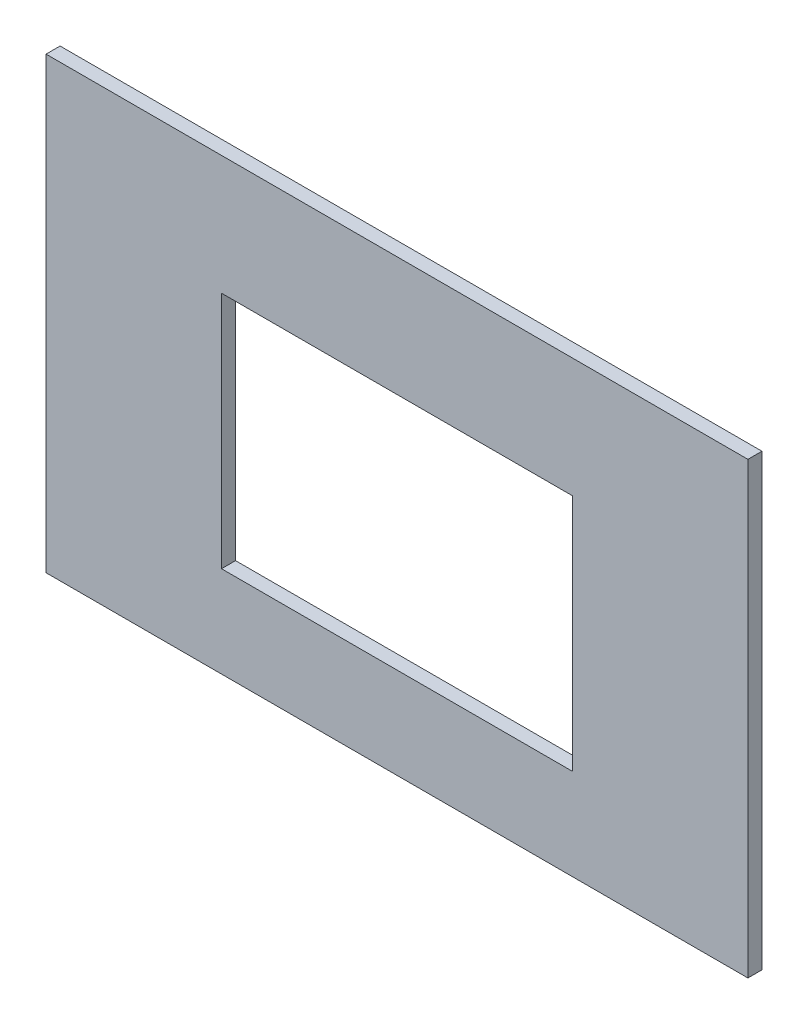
from build123d import *

# Parameters (mm, degrees)
SKETCH1_W           = 317.5
SKETCH1_H           = 203.2
BOSS_EXTRUDE1_DEPTH = 6.35
SKETCH2_W           = 158.75
SKETCH2_H           = 107.95
CUT_EXTRUDE1_DEPTH  = 6.35


with BuildPart() as part:
    # Sketch1 → Boss-Extrude1 (new body)
    with BuildSketch(Plane.XY):
        with Locations((158.75, 101.6)):
            Rectangle(SKETCH1_W, SKETCH1_H)
    extrude(amount=BOSS_EXTRUDE1_DEPTH)

    # Sketch2 → Cut-Extrude1 (cut)
    with BuildSketch(Plane.XY.offset(6.35)):
        with Locations((158.75, 95.25)):
            Rectangle(SKETCH2_W, SKETCH2_H)
    extrude(amount=-CUT_EXTRUDE1_DEPTH, mode=Mode.SUBTRACT)


solid = part.part
